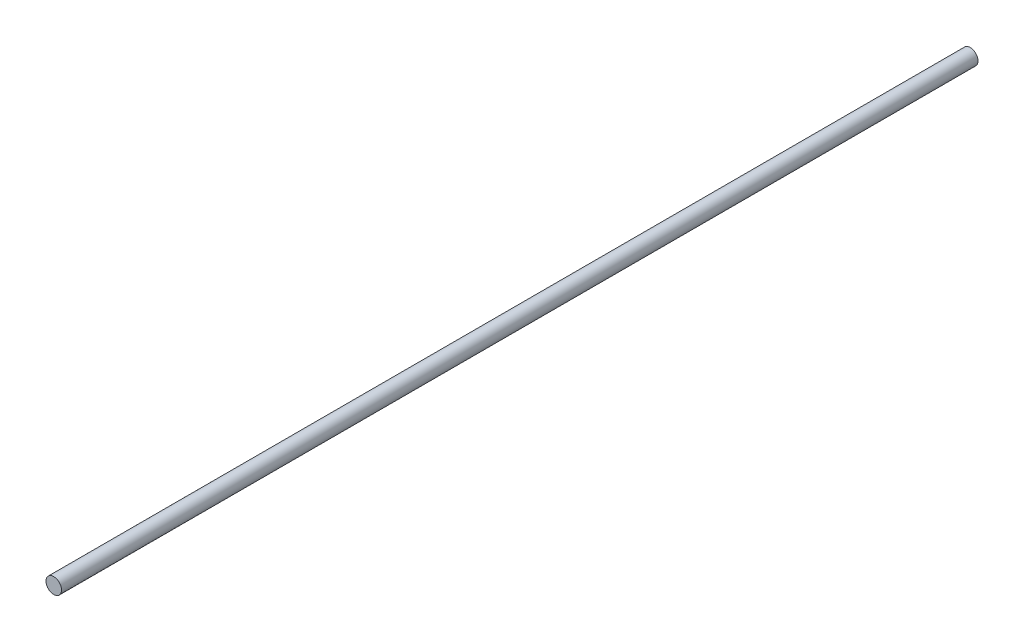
ISO-10303-21;
HEADER;
FILE_DESCRIPTION(('STEP AP214'),'2;1');
FILE_NAME('part.step','',(''),(''),'','','');
FILE_SCHEMA(('AUTOMOTIVE_DESIGN { 1 0 10303 214 1 1 1 1 }'));
ENDSEC;
DATA;
#1=APPLICATION_CONTEXT('core data for automotive mechanical design processes');
#2=APPLICATION_PROTOCOL_DEFINITION('international standard','automotive_design',2000,#1);
#3=PRODUCT_CONTEXT('',#1,'mechanical');
#4=PRODUCT('Part','Part','',(#3));
#5=PRODUCT_RELATED_PRODUCT_CATEGORY('part','',(#4));
#6=PRODUCT_DEFINITION_FORMATION('','',#4);
#7=PRODUCT_DEFINITION_CONTEXT('part definition',#1,'design');
#8=PRODUCT_DEFINITION('design','',#6,#7);
#9=PRODUCT_DEFINITION_SHAPE('','',#8);
#10=(LENGTH_UNIT() NAMED_UNIT(*) SI_UNIT(.MILLI.,.METRE.));
#11=(NAMED_UNIT(*) PLANE_ANGLE_UNIT() SI_UNIT($,.RADIAN.));
#12=(NAMED_UNIT(*) SI_UNIT($,.STERADIAN.) SOLID_ANGLE_UNIT());
#13=UNCERTAINTY_MEASURE_WITH_UNIT(LENGTH_MEASURE(1.E-05),#10,'distance_accuracy_value','');
#14=(GEOMETRIC_REPRESENTATION_CONTEXT(3) GLOBAL_UNCERTAINTY_ASSIGNED_CONTEXT((#13)) GLOBAL_UNIT_ASSIGNED_CONTEXT((#10,
#11,#12)) REPRESENTATION_CONTEXT('',''));
#15=CARTESIAN_POINT('',(0.,0.,0.));
#16=DIRECTION('',(0.,0.,1.));
#17=DIRECTION('',(1.,0.,0.));
#18=AXIS2_PLACEMENT_3D('',#15,#16,#17);
#19=CARTESIAN_POINT('',(0.,0.,59.));
#20=DIRECTION('',(0.,0.,-1.));
#21=DIRECTION('',(-1.,0.,0.));
#22=AXIS2_PLACEMENT_3D('',#19,#20,#21);
#23=CYLINDRICAL_SURFACE('',#22,0.5);
#24=CARTESIAN_POINT('',(0.,0.,59.));
#25=DIRECTION('',(0.,0.,1.));
#26=DIRECTION('',(1.,0.,0.));
#27=AXIS2_PLACEMENT_3D('',#24,#25,#26);
#28=CIRCLE('',#27,0.5);
#29=CARTESIAN_POINT('',(0.5,0.,59.));
#30=VERTEX_POINT('',#29);
#31=EDGE_CURVE('E10',#30,#30,#28,.T.);
#32=ORIENTED_EDGE('',*,*,#31,.F.);
#33=EDGE_LOOP('',(#32));
#34=FACE_BOUND('',#33,.T.);
#35=CARTESIAN_POINT('',(0.,0.,0.));
#36=DIRECTION('',(0.,0.,1.));
#37=DIRECTION('',(1.,0.,0.));
#38=AXIS2_PLACEMENT_3D('',#35,#36,#37);
#39=CIRCLE('',#38,0.5);
#40=CARTESIAN_POINT('',(0.5,0.,0.));
#41=VERTEX_POINT('',#40);
#42=EDGE_CURVE('E34',#41,#41,#39,.T.);
#43=ORIENTED_EDGE('',*,*,#42,.T.);
#44=EDGE_LOOP('',(#43));
#45=FACE_BOUND('',#44,.T.);
#46=ADVANCED_FACE('F28',(#34,#45),#23,.T.);
#47=CARTESIAN_POINT('',(0.,0.,59.));
#48=DIRECTION('',(0.,0.,1.));
#49=DIRECTION('',(1.,0.,0.));
#50=AXIS2_PLACEMENT_3D('',#47,#48,#49);
#51=PLANE('',#50);
#52=ORIENTED_EDGE('',*,*,#31,.T.);
#53=EDGE_LOOP('',(#52));
#54=FACE_BOUND('',#53,.T.);
#55=ADVANCED_FACE('F43',(#54),#51,.T.);
#56=CARTESIAN_POINT('',(0.,0.,0.));
#57=DIRECTION('',(0.,0.,1.));
#58=DIRECTION('',(1.,0.,0.));
#59=AXIS2_PLACEMENT_3D('',#56,#57,#58);
#60=PLANE('',#59);
#61=ORIENTED_EDGE('',*,*,#42,.F.);
#62=EDGE_LOOP('',(#61));
#63=FACE_BOUND('',#62,.T.);
#64=ADVANCED_FACE('F41',(#63),#60,.F.);
#65=CLOSED_SHELL('',(#46,#55,#64));
#66=MANIFOLD_SOLID_BREP('B2',#65);
#67=ADVANCED_BREP_SHAPE_REPRESENTATION('',(#18,#66),#14);
#68=SHAPE_DEFINITION_REPRESENTATION(#9,#67);
ENDSEC;
END-ISO-10303-21;
